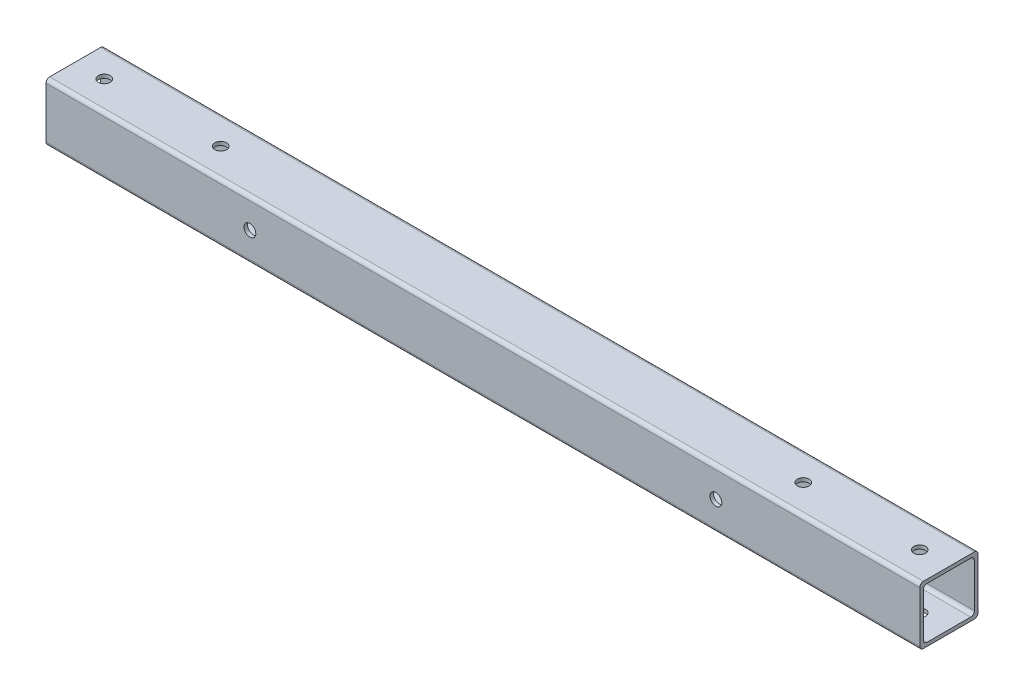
from build123d import *

# Parameters (mm, degrees)
SKETCH1_W          = 1524
SKETCH1_H          = 101.6
EXTRUDE1_DEPTH     = 101.6
CUT_EXTRUDE1_REACH = 1532.758
SKETCH2_W          = 88.9
SKETCH2_H          = 88.9
FILLET1_R          = 6.35
SKETCH3_R          = 10.31875
CUT_EXTRUDE2_DEPTH = 101.6
SKETCH4_R          = 10.31875
CUT_EXTRUDE3_DEPTH = 101.6
SKETCH5_R          = 10.31875
CUT_EXTRUDE4_DEPTH = 101.6


with BuildPart() as part:
    # Sketch1 → Extrude1 (new body)
    with BuildSketch(Plane(origin=(0, 0, 0), x_dir=(1, 0, 0), z_dir=(0, 1, 0))):
        with Locations((-762, -50.8)):
            Rectangle(SKETCH1_W, SKETCH1_H)
    extrude(amount=EXTRUDE1_DEPTH)

    # Sketch2 → Cut-Extrude1 (cut, up to next)
    with BuildSketch(Plane.ZY.offset(1524), mode=Mode.PRIVATE) as cut_extrude1_sk1:
        with Locations((50.8, 50.8)):
            Rectangle(SKETCH2_W, SKETCH2_H)
    cut_extrude1_tool1 = extrude(cut_extrude1_sk1.sketch, amount=-CUT_EXTRUDE1_REACH, mode=Mode.PRIVATE) & part.part
    add(cut_extrude1_tool1.solids().sort_by_distance((-1524, 50.8, 50.8))[0], mode=Mode.SUBTRACT)

    # Fillet1
    fillet1_edges = [part.edges().sort_by_distance(p)[0] for p in [
        (-762, 101.6, 101.6),
        (-762, 6.35, 6.35),
        (-762, 95.25, 6.35),
        (-762, 95.25, 95.25),
        (-762, 6.35, 95.25),
        (-762, 0, 101.6),
        (-762, 0, 0),
        (-762, 101.6, 0),
    ]]
    fillet(fillet1_edges, radius=FILLET1_R)

    # Sketch3 → Cut-Extrude2 (cut)
    with BuildSketch(Plane.XZ):
        with Locations(Location((-1473.2, 50.8, 0), (0, 0, 270))):
            Circle(SKETCH3_R)
    cut_extrude2 = extrude(amount=-CUT_EXTRUDE2_DEPTH, mode=Mode.SUBTRACT)

    # Sketch4 → Cut-Extrude3 (cut)
    with BuildSketch(Plane.XZ):
        with Locations(Location((-1270, 50.8, 0), (0, 0, 270))):
            Circle(SKETCH4_R)
    cut_extrude3 = extrude(amount=-CUT_EXTRUDE3_DEPTH, mode=Mode.SUBTRACT)

    # Sketch5 → Cut-Extrude4 (cut)
    with BuildSketch(Plane.XY.offset(101.6)):
        with Locations((-1168.4, 50.8)):
            Circle(SKETCH5_R)
    cut_extrude4 = extrude(amount=-CUT_EXTRUDE4_DEPTH, mode=Mode.SUBTRACT)

    # Mirror1: Cut-Extrude2, Cut-Extrude3, Cut-Extrude4 across plane
    add(cut_extrude2.mirror(Plane(origin=(-762, 0, 0), x_dir=(0, 0, 1), z_dir=(1, 0, 0))), mode=Mode.SUBTRACT)
    add(cut_extrude3.mirror(Plane(origin=(-762, 0, 0), x_dir=(0, 0, 1), z_dir=(1, 0, 0))), mode=Mode.SUBTRACT)
    add(cut_extrude4.mirror(Plane(origin=(-762, 0, 0), x_dir=(0, 0, 1), z_dir=(1, 0, 0))), mode=Mode.SUBTRACT)


solid = part.part
